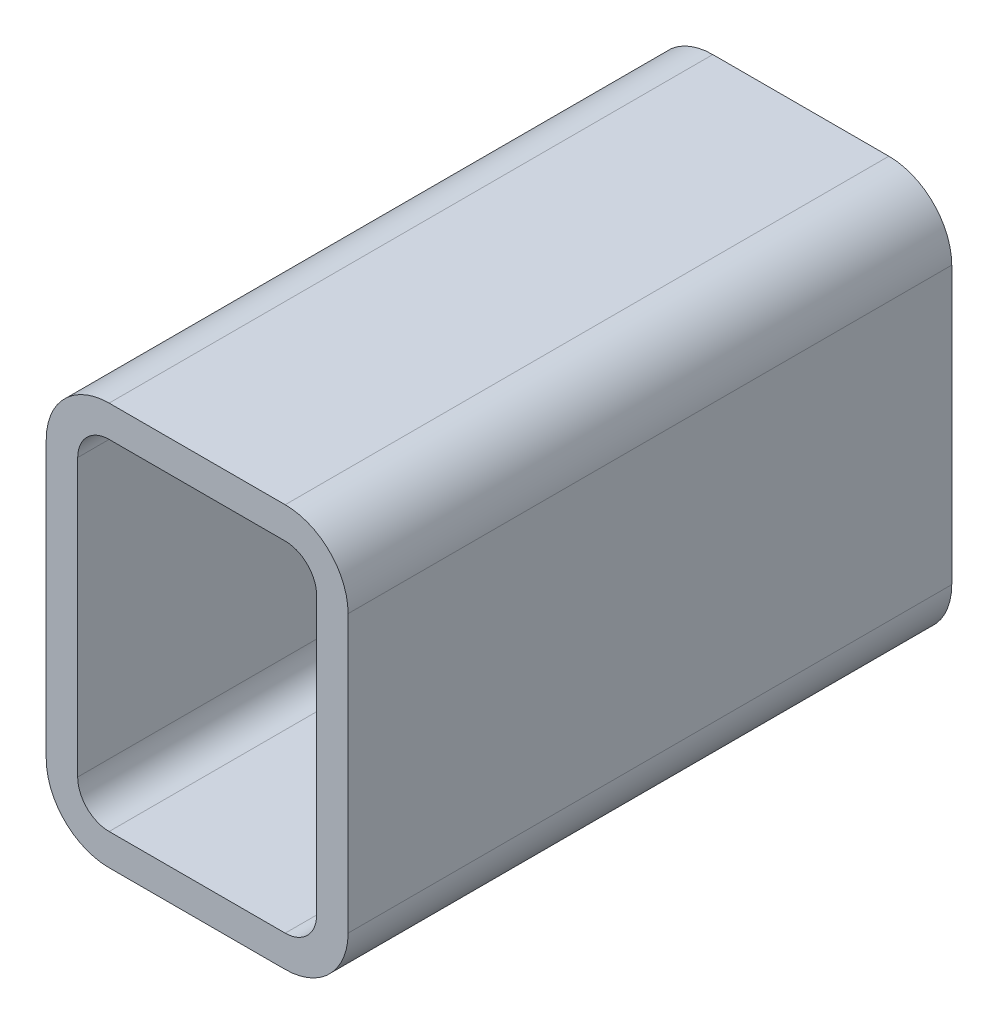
ISO-10303-21;
HEADER;
FILE_DESCRIPTION(('STEP AP214'),'2;1');
FILE_NAME('part.step','',(''),(''),'','','');
FILE_SCHEMA(('AUTOMOTIVE_DESIGN { 1 0 10303 214 1 1 1 1 }'));
ENDSEC;
DATA;
#1=APPLICATION_CONTEXT('core data for automotive mechanical design processes');
#2=APPLICATION_PROTOCOL_DEFINITION('international standard','automotive_design',2000,#1);
#3=PRODUCT_CONTEXT('',#1,'mechanical');
#4=PRODUCT('Part','Part','',(#3));
#5=PRODUCT_RELATED_PRODUCT_CATEGORY('part','',(#4));
#6=PRODUCT_DEFINITION_FORMATION('','',#4);
#7=PRODUCT_DEFINITION_CONTEXT('part definition',#1,'design');
#8=PRODUCT_DEFINITION('design','',#6,#7);
#9=PRODUCT_DEFINITION_SHAPE('','',#8);
#10=(LENGTH_UNIT() NAMED_UNIT(*) SI_UNIT(.MILLI.,.METRE.));
#11=(NAMED_UNIT(*) PLANE_ANGLE_UNIT() SI_UNIT($,.RADIAN.));
#12=(NAMED_UNIT(*) SI_UNIT($,.STERADIAN.) SOLID_ANGLE_UNIT());
#13=UNCERTAINTY_MEASURE_WITH_UNIT(LENGTH_MEASURE(1.E-05),#10,'distance_accuracy_value','');
#14=(GEOMETRIC_REPRESENTATION_CONTEXT(3) GLOBAL_UNCERTAINTY_ASSIGNED_CONTEXT((#13)) GLOBAL_UNIT_ASSIGNED_CONTEXT((#10,
#11,#12)) REPRESENTATION_CONTEXT('',''));
#15=CARTESIAN_POINT('',(0.,0.,0.));
#16=DIRECTION('',(0.,0.,1.));
#17=DIRECTION('',(1.,0.,0.));
#18=AXIS2_PLACEMENT_3D('',#15,#16,#17);
#19=CARTESIAN_POINT('',(31.7973013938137,173.416130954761,304.8));
#20=DIRECTION('',(0.,0.,1.));
#21=DIRECTION('',(1.,0.,0.));
#22=AXIS2_PLACEMENT_3D('',#19,#20,#21);
#23=PLANE('',#22);
#24=CARTESIAN_POINT('',(31.7973013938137,173.416130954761,304.8));
#25=DIRECTION('',(0.,0.,1.));
#26=DIRECTION('',(1.,0.,0.));
#27=AXIS2_PLACEMENT_3D('',#24,#25,#26);
#28=CIRCLE('',#27,31.75);
#29=CARTESIAN_POINT('',(31.7973013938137,205.166130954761,304.8));
#30=VERTEX_POINT('',#29);
#31=CARTESIAN_POINT('',(0.0473013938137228,173.416130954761,304.8));
#32=VERTEX_POINT('',#31);
#33=EDGE_CURVE('E211',#30,#32,#28,.T.);
#34=ORIENTED_EDGE('',*,*,#33,.T.);
#35=DIRECTION('',(0.,-1.,0.));
#36=VECTOR('',#35,1.);
#37=CARTESIAN_POINT('',(0.0473013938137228,33.7161309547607,304.8));
#38=LINE('',#37,#36);
#39=CARTESIAN_POINT('',(0.0473013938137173,33.7161309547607,304.8));
#40=VERTEX_POINT('',#39);
#41=EDGE_CURVE('E214',#32,#40,#38,.T.);
#42=ORIENTED_EDGE('',*,*,#41,.T.);
#43=CARTESIAN_POINT('',(31.7973013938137,33.7161309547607,304.8));
#44=DIRECTION('',(0.,0.,1.));
#45=DIRECTION('',(1.,0.,0.));
#46=AXIS2_PLACEMENT_3D('',#43,#44,#45);
#47=CIRCLE('',#46,31.75);
#48=CARTESIAN_POINT('',(31.7973013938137,1.96613095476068,304.8));
#49=VERTEX_POINT('',#48);
#50=EDGE_CURVE('E217',#40,#49,#47,.T.);
#51=ORIENTED_EDGE('',*,*,#50,.T.);
#52=DIRECTION('',(1.,0.,0.));
#53=VECTOR('',#52,1.);
#54=CARTESIAN_POINT('',(120.697301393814,1.96613095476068,304.8));
#55=LINE('',#54,#53);
#56=CARTESIAN_POINT('',(120.697301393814,1.96613095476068,304.8));
#57=VERTEX_POINT('',#56);
#58=EDGE_CURVE('E219',#49,#57,#55,.T.);
#59=ORIENTED_EDGE('',*,*,#58,.T.);
#60=CARTESIAN_POINT('',(120.697301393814,33.7161309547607,304.8));
#61=DIRECTION('',(0.,0.,1.));
#62=DIRECTION('',(1.,0.,0.));
#63=AXIS2_PLACEMENT_3D('',#60,#61,#62);
#64=CIRCLE('',#63,31.75);
#65=CARTESIAN_POINT('',(152.447301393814,33.7161309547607,304.8));
#66=VERTEX_POINT('',#65);
#67=EDGE_CURVE('E221',#57,#66,#64,.T.);
#68=ORIENTED_EDGE('',*,*,#67,.T.);
#69=DIRECTION('',(0.,1.,0.));
#70=VECTOR('',#69,1.);
#71=CARTESIAN_POINT('',(152.447301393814,173.416130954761,304.8));
#72=LINE('',#71,#70);
#73=CARTESIAN_POINT('',(152.447301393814,173.416130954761,304.8));
#74=VERTEX_POINT('',#73);
#75=EDGE_CURVE('E223',#66,#74,#72,.T.);
#76=ORIENTED_EDGE('',*,*,#75,.T.);
#77=CARTESIAN_POINT('',(120.697301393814,173.416130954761,304.8));
#78=DIRECTION('',(0.,0.,1.));
#79=DIRECTION('',(1.,0.,0.));
#80=AXIS2_PLACEMENT_3D('',#77,#78,#79);
#81=CIRCLE('',#80,31.75);
#82=CARTESIAN_POINT('',(120.697301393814,205.166130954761,304.8));
#83=VERTEX_POINT('',#82);
#84=EDGE_CURVE('E225',#74,#83,#81,.T.);
#85=ORIENTED_EDGE('',*,*,#84,.T.);
#86=DIRECTION('',(-1.,0.,0.));
#87=VECTOR('',#86,1.);
#88=CARTESIAN_POINT('',(31.7973013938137,205.166130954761,304.8));
#89=LINE('',#88,#87);
#90=EDGE_CURVE('E227',#83,#30,#89,.T.);
#91=ORIENTED_EDGE('',*,*,#90,.T.);
#92=EDGE_LOOP('',(#34,#42,#51,#59,#68,#76,#85,#91));
#93=FACE_BOUND('',#92,.T.);
#94=DIRECTION('',(0.,-1.,0.));
#95=VECTOR('',#94,1.);
#96=CARTESIAN_POINT('',(15.9223013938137,33.7161309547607,304.8));
#97=LINE('',#96,#95);
#98=CARTESIAN_POINT('',(15.9223013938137,173.416130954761,304.8));
#99=VERTEX_POINT('',#98);
#100=CARTESIAN_POINT('',(15.9223013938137,33.7161309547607,304.8));
#101=VERTEX_POINT('',#100);
#102=EDGE_CURVE('E154',#99,#101,#97,.T.);
#103=ORIENTED_EDGE('',*,*,#102,.F.);
#104=CARTESIAN_POINT('',(31.7973013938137,173.416130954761,304.8));
#105=DIRECTION('',(0.,0.,1.));
#106=DIRECTION('',(1.,0.,0.));
#107=AXIS2_PLACEMENT_3D('',#104,#105,#106);
#108=CIRCLE('',#107,15.875);
#109=CARTESIAN_POINT('',(31.7973013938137,189.291130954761,304.8));
#110=VERTEX_POINT('',#109);
#111=EDGE_CURVE('E146',#110,#99,#108,.T.);
#112=ORIENTED_EDGE('',*,*,#111,.F.);
#113=DIRECTION('',(-1.,0.,0.));
#114=VECTOR('',#113,1.);
#115=CARTESIAN_POINT('',(31.7973013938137,189.291130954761,304.8));
#116=LINE('',#115,#114);
#117=CARTESIAN_POINT('',(120.697301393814,189.291130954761,304.8));
#118=VERTEX_POINT('',#117);
#119=EDGE_CURVE('E179',#118,#110,#116,.T.);
#120=ORIENTED_EDGE('',*,*,#119,.F.);
#121=CARTESIAN_POINT('',(120.697301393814,173.416130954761,304.8));
#122=DIRECTION('',(0.,0.,1.));
#123=DIRECTION('',(1.,0.,0.));
#124=AXIS2_PLACEMENT_3D('',#121,#122,#123);
#125=CIRCLE('',#124,15.875);
#126=CARTESIAN_POINT('',(136.572301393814,173.416130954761,304.8));
#127=VERTEX_POINT('',#126);
#128=EDGE_CURVE('E177',#127,#118,#125,.T.);
#129=ORIENTED_EDGE('',*,*,#128,.F.);
#130=DIRECTION('',(0.,1.,0.));
#131=VECTOR('',#130,1.);
#132=CARTESIAN_POINT('',(136.572301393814,173.416130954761,304.8));
#133=LINE('',#132,#131);
#134=CARTESIAN_POINT('',(136.572301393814,33.7161309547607,304.8));
#135=VERTEX_POINT('',#134);
#136=EDGE_CURVE('E175',#135,#127,#133,.T.);
#137=ORIENTED_EDGE('',*,*,#136,.F.);
#138=CARTESIAN_POINT('',(120.697301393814,33.7161309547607,304.8));
#139=DIRECTION('',(0.,0.,1.));
#140=DIRECTION('',(1.,0.,0.));
#141=AXIS2_PLACEMENT_3D('',#138,#139,#140);
#142=CIRCLE('',#141,15.875);
#143=CARTESIAN_POINT('',(120.697301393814,17.8411309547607,304.8));
#144=VERTEX_POINT('',#143);
#145=EDGE_CURVE('E173',#144,#135,#142,.T.);
#146=ORIENTED_EDGE('',*,*,#145,.F.);
#147=DIRECTION('',(1.,0.,0.));
#148=VECTOR('',#147,1.);
#149=CARTESIAN_POINT('',(120.697301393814,17.8411309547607,304.8));
#150=LINE('',#149,#148);
#151=CARTESIAN_POINT('',(31.7973013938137,17.8411309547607,304.8));
#152=VERTEX_POINT('',#151);
#153=EDGE_CURVE('E169',#152,#144,#150,.T.);
#154=ORIENTED_EDGE('',*,*,#153,.F.);
#155=CARTESIAN_POINT('',(31.7973013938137,33.7161309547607,304.8));
#156=DIRECTION('',(0.,0.,1.));
#157=DIRECTION('',(1.,0.,0.));
#158=AXIS2_PLACEMENT_3D('',#155,#156,#157);
#159=CIRCLE('',#158,15.875);
#160=EDGE_CURVE('E167',#101,#152,#159,.T.);
#161=ORIENTED_EDGE('',*,*,#160,.F.);
#162=EDGE_LOOP('',(#103,#112,#120,#129,#137,#146,#154,#161));
#163=FACE_BOUND('',#162,.T.);
#164=ADVANCED_FACE('F33',(#93,#163),#23,.T.);
#165=CARTESIAN_POINT('',(31.7973013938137,173.416130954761,0.));
#166=DIRECTION('',(0.,0.,1.));
#167=DIRECTION('',(1.,0.,0.));
#168=AXIS2_PLACEMENT_3D('',#165,#166,#167);
#169=PLANE('',#168);
#170=CARTESIAN_POINT('',(31.7973013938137,173.416130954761,0.));
#171=DIRECTION('',(0.,0.,1.));
#172=DIRECTION('',(1.,0.,0.));
#173=AXIS2_PLACEMENT_3D('',#170,#171,#172);
#174=CIRCLE('',#173,31.75);
#175=CARTESIAN_POINT('',(31.7973013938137,205.166130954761,0.));
#176=VERTEX_POINT('',#175);
#177=CARTESIAN_POINT('',(0.0473013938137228,173.416130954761,0.));
#178=VERTEX_POINT('',#177);
#179=EDGE_CURVE('E162',#176,#178,#174,.T.);
#180=ORIENTED_EDGE('',*,*,#179,.F.);
#181=DIRECTION('',(-1.,0.,0.));
#182=VECTOR('',#181,1.);
#183=CARTESIAN_POINT('',(31.7973013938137,205.166130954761,0.));
#184=LINE('',#183,#182);
#185=CARTESIAN_POINT('',(120.697301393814,205.166130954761,0.));
#186=VERTEX_POINT('',#185);
#187=EDGE_CURVE('E215',#186,#176,#184,.T.);
#188=ORIENTED_EDGE('',*,*,#187,.F.);
#189=CARTESIAN_POINT('',(120.697301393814,173.416130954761,0.));
#190=DIRECTION('',(0.,0.,1.));
#191=DIRECTION('',(1.,0.,0.));
#192=AXIS2_PLACEMENT_3D('',#189,#190,#191);
#193=CIRCLE('',#192,31.75);
#194=CARTESIAN_POINT('',(152.447301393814,173.416130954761,0.));
#195=VERTEX_POINT('',#194);
#196=EDGE_CURVE('E242',#195,#186,#193,.T.);
#197=ORIENTED_EDGE('',*,*,#196,.F.);
#198=DIRECTION('',(0.,1.,0.));
#199=VECTOR('',#198,1.);
#200=CARTESIAN_POINT('',(152.447301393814,173.416130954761,0.));
#201=LINE('',#200,#199);
#202=CARTESIAN_POINT('',(152.447301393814,33.7161309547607,0.));
#203=VERTEX_POINT('',#202);
#204=EDGE_CURVE('E240',#203,#195,#201,.T.);
#205=ORIENTED_EDGE('',*,*,#204,.F.);
#206=CARTESIAN_POINT('',(120.697301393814,33.7161309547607,0.));
#207=DIRECTION('',(0.,0.,1.));
#208=DIRECTION('',(1.,0.,0.));
#209=AXIS2_PLACEMENT_3D('',#206,#207,#208);
#210=CIRCLE('',#209,31.75);
#211=CARTESIAN_POINT('',(120.697301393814,1.96613095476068,0.));
#212=VERTEX_POINT('',#211);
#213=EDGE_CURVE('E238',#212,#203,#210,.T.);
#214=ORIENTED_EDGE('',*,*,#213,.F.);
#215=DIRECTION('',(1.,0.,0.));
#216=VECTOR('',#215,1.);
#217=CARTESIAN_POINT('',(120.697301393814,1.96613095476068,0.));
#218=LINE('',#217,#216);
#219=CARTESIAN_POINT('',(31.7973013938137,1.96613095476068,0.));
#220=VERTEX_POINT('',#219);
#221=EDGE_CURVE('E236',#220,#212,#218,.T.);
#222=ORIENTED_EDGE('',*,*,#221,.F.);
#223=CARTESIAN_POINT('',(31.7973013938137,33.7161309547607,0.));
#224=DIRECTION('',(0.,0.,1.));
#225=DIRECTION('',(1.,0.,0.));
#226=AXIS2_PLACEMENT_3D('',#223,#224,#225);
#227=CIRCLE('',#226,31.75);
#228=CARTESIAN_POINT('',(0.0473013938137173,33.7161309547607,0.));
#229=VERTEX_POINT('',#228);
#230=EDGE_CURVE('E234',#229,#220,#227,.T.);
#231=ORIENTED_EDGE('',*,*,#230,.F.);
#232=DIRECTION('',(0.,-1.,0.));
#233=VECTOR('',#232,1.);
#234=CARTESIAN_POINT('',(0.0473013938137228,33.7161309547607,0.));
#235=LINE('',#234,#233);
#236=EDGE_CURVE('E232',#178,#229,#235,.T.);
#237=ORIENTED_EDGE('',*,*,#236,.F.);
#238=EDGE_LOOP('',(#180,#188,#197,#205,#214,#222,#231,#237));
#239=FACE_BOUND('',#238,.T.);
#240=CARTESIAN_POINT('',(31.7973013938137,173.416130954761,0.));
#241=DIRECTION('',(0.,0.,1.));
#242=DIRECTION('',(1.,0.,0.));
#243=AXIS2_PLACEMENT_3D('',#240,#241,#242);
#244=CIRCLE('',#243,15.875);
#245=CARTESIAN_POINT('',(31.7973013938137,189.291130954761,0.));
#246=VERTEX_POINT('',#245);
#247=CARTESIAN_POINT('',(15.9223013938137,173.416130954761,0.));
#248=VERTEX_POINT('',#247);
#249=EDGE_CURVE('E56',#246,#248,#244,.T.);
#250=ORIENTED_EDGE('',*,*,#249,.T.);
#251=DIRECTION('',(0.,-1.,0.));
#252=VECTOR('',#251,1.);
#253=CARTESIAN_POINT('',(15.9223013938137,33.7161309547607,0.));
#254=LINE('',#253,#252);
#255=CARTESIAN_POINT('',(15.9223013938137,33.7161309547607,0.));
#256=VERTEX_POINT('',#255);
#257=EDGE_CURVE('E161',#248,#256,#254,.T.);
#258=ORIENTED_EDGE('',*,*,#257,.T.);
#259=CARTESIAN_POINT('',(31.7973013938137,33.7161309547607,0.));
#260=DIRECTION('',(0.,0.,1.));
#261=DIRECTION('',(1.,0.,0.));
#262=AXIS2_PLACEMENT_3D('',#259,#260,#261);
#263=CIRCLE('',#262,15.875);
#264=CARTESIAN_POINT('',(31.7973013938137,17.8411309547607,0.));
#265=VERTEX_POINT('',#264);
#266=EDGE_CURVE('E183',#256,#265,#263,.T.);
#267=ORIENTED_EDGE('',*,*,#266,.T.);
#268=DIRECTION('',(1.,0.,0.));
#269=VECTOR('',#268,1.);
#270=CARTESIAN_POINT('',(120.697301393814,17.8411309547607,0.));
#271=LINE('',#270,#269);
#272=CARTESIAN_POINT('',(120.697301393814,17.8411309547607,0.));
#273=VERTEX_POINT('',#272);
#274=EDGE_CURVE('E186',#265,#273,#271,.T.);
#275=ORIENTED_EDGE('',*,*,#274,.T.);
#276=CARTESIAN_POINT('',(120.697301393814,33.7161309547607,0.));
#277=DIRECTION('',(0.,0.,1.));
#278=DIRECTION('',(1.,0.,0.));
#279=AXIS2_PLACEMENT_3D('',#276,#277,#278);
#280=CIRCLE('',#279,15.875);
#281=CARTESIAN_POINT('',(136.572301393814,33.7161309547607,0.));
#282=VERTEX_POINT('',#281);
#283=EDGE_CURVE('E189',#273,#282,#280,.T.);
#284=ORIENTED_EDGE('',*,*,#283,.T.);
#285=DIRECTION('',(0.,1.,0.));
#286=VECTOR('',#285,1.);
#287=CARTESIAN_POINT('',(136.572301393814,173.416130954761,0.));
#288=LINE('',#287,#286);
#289=CARTESIAN_POINT('',(136.572301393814,173.416130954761,0.));
#290=VERTEX_POINT('',#289);
#291=EDGE_CURVE('E192',#282,#290,#288,.T.);
#292=ORIENTED_EDGE('',*,*,#291,.T.);
#293=CARTESIAN_POINT('',(120.697301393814,173.416130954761,0.));
#294=DIRECTION('',(0.,0.,1.));
#295=DIRECTION('',(1.,0.,0.));
#296=AXIS2_PLACEMENT_3D('',#293,#294,#295);
#297=CIRCLE('',#296,15.875);
#298=CARTESIAN_POINT('',(120.697301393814,189.291130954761,0.));
#299=VERTEX_POINT('',#298);
#300=EDGE_CURVE('E195',#290,#299,#297,.T.);
#301=ORIENTED_EDGE('',*,*,#300,.T.);
#302=DIRECTION('',(-1.,0.,0.));
#303=VECTOR('',#302,1.);
#304=CARTESIAN_POINT('',(31.7973013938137,189.291130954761,0.));
#305=LINE('',#304,#303);
#306=EDGE_CURVE('E155',#299,#246,#305,.T.);
#307=ORIENTED_EDGE('',*,*,#306,.T.);
#308=EDGE_LOOP('',(#250,#258,#267,#275,#284,#292,#301,#307));
#309=FACE_BOUND('',#308,.T.);
#310=ADVANCED_FACE('F272',(#239,#309),#169,.F.);
#311=CARTESIAN_POINT('',(31.7973013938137,173.416130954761,304.8));
#312=DIRECTION('',(0.,0.,-1.));
#313=DIRECTION('',(-1.,0.,0.));
#314=AXIS2_PLACEMENT_3D('',#311,#312,#313);
#315=CYLINDRICAL_SURFACE('',#314,31.75);
#316=ORIENTED_EDGE('',*,*,#179,.T.);
#317=DIRECTION('',(0.,0.,-1.));
#318=VECTOR('',#317,1.);
#319=CARTESIAN_POINT('',(0.0473013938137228,173.416130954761,304.8));
#320=LINE('',#319,#318);
#321=EDGE_CURVE('E11',#32,#178,#320,.T.);
#322=ORIENTED_EDGE('',*,*,#321,.F.);
#323=ORIENTED_EDGE('',*,*,#33,.F.);
#324=DIRECTION('',(0.,0.,-1.));
#325=VECTOR('',#324,1.);
#326=CARTESIAN_POINT('',(31.7973013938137,205.166130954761,304.8));
#327=LINE('',#326,#325);
#328=EDGE_CURVE('E229',#30,#176,#327,.T.);
#329=ORIENTED_EDGE('',*,*,#328,.T.);
#330=EDGE_LOOP('',(#316,#322,#323,#329));
#331=FACE_BOUND('',#330,.T.);
#332=ADVANCED_FACE('F35',(#331),#315,.T.);
#333=CARTESIAN_POINT('',(0.0473013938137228,33.7161309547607,304.8));
#334=DIRECTION('',(1.,0.,0.));
#335=DIRECTION('',(0.,0.,-1.));
#336=AXIS2_PLACEMENT_3D('',#333,#334,#335);
#337=PLANE('',#336);
#338=ORIENTED_EDGE('',*,*,#236,.T.);
#339=DIRECTION('',(0.,0.,-1.));
#340=VECTOR('',#339,1.);
#341=CARTESIAN_POINT('',(0.0473013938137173,33.7161309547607,304.8));
#342=LINE('',#341,#340);
#343=EDGE_CURVE('E41',#40,#229,#342,.T.);
#344=ORIENTED_EDGE('',*,*,#343,.F.);
#345=ORIENTED_EDGE('',*,*,#41,.F.);
#346=ORIENTED_EDGE('',*,*,#321,.T.);
#347=EDGE_LOOP('',(#338,#344,#345,#346));
#348=FACE_BOUND('',#347,.T.);
#349=ADVANCED_FACE('F289',(#348),#337,.F.);
#350=CARTESIAN_POINT('',(31.7973013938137,33.7161309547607,304.8));
#351=DIRECTION('',(0.,0.,-1.));
#352=DIRECTION('',(-1.,0.,0.));
#353=AXIS2_PLACEMENT_3D('',#350,#351,#352);
#354=CYLINDRICAL_SURFACE('',#353,31.75);
#355=ORIENTED_EDGE('',*,*,#230,.T.);
#356=DIRECTION('',(0.,0.,-1.));
#357=VECTOR('',#356,1.);
#358=CARTESIAN_POINT('',(31.7973013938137,1.96613095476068,304.8));
#359=LINE('',#358,#357);
#360=EDGE_CURVE('E259',#49,#220,#359,.T.);
#361=ORIENTED_EDGE('',*,*,#360,.F.);
#362=ORIENTED_EDGE('',*,*,#50,.F.);
#363=ORIENTED_EDGE('',*,*,#343,.T.);
#364=EDGE_LOOP('',(#355,#361,#362,#363));
#365=FACE_BOUND('',#364,.T.);
#366=ADVANCED_FACE('F266',(#365),#354,.T.);
#367=CARTESIAN_POINT('',(120.697301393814,1.96613095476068,304.8));
#368=DIRECTION('',(0.,1.,0.));
#369=DIRECTION('',(0.,0.,1.));
#370=AXIS2_PLACEMENT_3D('',#367,#368,#369);
#371=PLANE('',#370);
#372=ORIENTED_EDGE('',*,*,#221,.T.);
#373=DIRECTION('',(0.,0.,-1.));
#374=VECTOR('',#373,1.);
#375=CARTESIAN_POINT('',(120.697301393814,1.96613095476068,304.8));
#376=LINE('',#375,#374);
#377=EDGE_CURVE('E256',#57,#212,#376,.T.);
#378=ORIENTED_EDGE('',*,*,#377,.F.);
#379=ORIENTED_EDGE('',*,*,#58,.F.);
#380=ORIENTED_EDGE('',*,*,#360,.T.);
#381=EDGE_LOOP('',(#372,#378,#379,#380));
#382=FACE_BOUND('',#381,.T.);
#383=ADVANCED_FACE('F278',(#382),#371,.F.);
#384=CARTESIAN_POINT('',(120.697301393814,33.7161309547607,304.8));
#385=DIRECTION('',(0.,0.,-1.));
#386=DIRECTION('',(-1.,0.,0.));
#387=AXIS2_PLACEMENT_3D('',#384,#385,#386);
#388=CYLINDRICAL_SURFACE('',#387,31.75);
#389=ORIENTED_EDGE('',*,*,#213,.T.);
#390=DIRECTION('',(0.,0.,-1.));
#391=VECTOR('',#390,1.);
#392=CARTESIAN_POINT('',(152.447301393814,33.7161309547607,304.8));
#393=LINE('',#392,#391);
#394=EDGE_CURVE('E253',#66,#203,#393,.T.);
#395=ORIENTED_EDGE('',*,*,#394,.F.);
#396=ORIENTED_EDGE('',*,*,#67,.F.);
#397=ORIENTED_EDGE('',*,*,#377,.T.);
#398=EDGE_LOOP('',(#389,#395,#396,#397));
#399=FACE_BOUND('',#398,.T.);
#400=ADVANCED_FACE('F282',(#399),#388,.T.);
#401=CARTESIAN_POINT('',(152.447301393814,173.416130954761,304.8));
#402=DIRECTION('',(-1.,0.,0.));
#403=DIRECTION('',(0.,0.,1.));
#404=AXIS2_PLACEMENT_3D('',#401,#402,#403);
#405=PLANE('',#404);
#406=ORIENTED_EDGE('',*,*,#204,.T.);
#407=DIRECTION('',(0.,0.,-1.));
#408=VECTOR('',#407,1.);
#409=CARTESIAN_POINT('',(152.447301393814,173.416130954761,304.8));
#410=LINE('',#409,#408);
#411=EDGE_CURVE('E250',#74,#195,#410,.T.);
#412=ORIENTED_EDGE('',*,*,#411,.F.);
#413=ORIENTED_EDGE('',*,*,#75,.F.);
#414=ORIENTED_EDGE('',*,*,#394,.T.);
#415=EDGE_LOOP('',(#406,#412,#413,#414));
#416=FACE_BOUND('',#415,.T.);
#417=ADVANCED_FACE('F302',(#416),#405,.F.);
#418=CARTESIAN_POINT('',(120.697301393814,173.416130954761,304.8));
#419=DIRECTION('',(0.,0.,-1.));
#420=DIRECTION('',(-1.,0.,0.));
#421=AXIS2_PLACEMENT_3D('',#418,#419,#420);
#422=CYLINDRICAL_SURFACE('',#421,31.75);
#423=ORIENTED_EDGE('',*,*,#196,.T.);
#424=DIRECTION('',(0.,0.,-1.));
#425=VECTOR('',#424,1.);
#426=CARTESIAN_POINT('',(120.697301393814,205.166130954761,304.8));
#427=LINE('',#426,#425);
#428=EDGE_CURVE('E247',#83,#186,#427,.T.);
#429=ORIENTED_EDGE('',*,*,#428,.F.);
#430=ORIENTED_EDGE('',*,*,#84,.F.);
#431=ORIENTED_EDGE('',*,*,#411,.T.);
#432=EDGE_LOOP('',(#423,#429,#430,#431));
#433=FACE_BOUND('',#432,.T.);
#434=ADVANCED_FACE('F300',(#433),#422,.T.);
#435=CARTESIAN_POINT('',(31.7973013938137,205.166130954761,304.8));
#436=DIRECTION('',(0.,-1.,0.));
#437=DIRECTION('',(0.,0.,-1.));
#438=AXIS2_PLACEMENT_3D('',#435,#436,#437);
#439=PLANE('',#438);
#440=ORIENTED_EDGE('',*,*,#187,.T.);
#441=ORIENTED_EDGE('',*,*,#328,.F.);
#442=ORIENTED_EDGE('',*,*,#90,.F.);
#443=ORIENTED_EDGE('',*,*,#428,.T.);
#444=EDGE_LOOP('',(#440,#441,#442,#443));
#445=FACE_BOUND('',#444,.T.);
#446=ADVANCED_FACE('F295',(#445),#439,.F.);
#447=CARTESIAN_POINT('',(31.7973013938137,173.416130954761,304.8));
#448=DIRECTION('',(0.,0.,-1.));
#449=DIRECTION('',(-1.,0.,0.));
#450=AXIS2_PLACEMENT_3D('',#447,#448,#449);
#451=CYLINDRICAL_SURFACE('',#450,15.875);
#452=ORIENTED_EDGE('',*,*,#249,.F.);
#453=DIRECTION('',(0.,0.,-1.));
#454=VECTOR('',#453,1.);
#455=CARTESIAN_POINT('',(31.7973013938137,189.291130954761,304.8));
#456=LINE('',#455,#454);
#457=EDGE_CURVE('E150',#110,#246,#456,.T.);
#458=ORIENTED_EDGE('',*,*,#457,.F.);
#459=ORIENTED_EDGE('',*,*,#111,.T.);
#460=DIRECTION('',(0.,0.,-1.));
#461=VECTOR('',#460,1.);
#462=CARTESIAN_POINT('',(15.9223013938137,173.416130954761,304.8));
#463=LINE('',#462,#461);
#464=EDGE_CURVE('E149',#99,#248,#463,.T.);
#465=ORIENTED_EDGE('',*,*,#464,.T.);
#466=EDGE_LOOP('',(#452,#458,#459,#465));
#467=FACE_BOUND('',#466,.T.);
#468=ADVANCED_FACE('F148',(#467),#451,.F.);
#469=CARTESIAN_POINT('',(15.9223013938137,33.7161309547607,304.8));
#470=DIRECTION('',(1.,0.,0.));
#471=DIRECTION('',(0.,0.,-1.));
#472=AXIS2_PLACEMENT_3D('',#469,#470,#471);
#473=PLANE('',#472);
#474=ORIENTED_EDGE('',*,*,#257,.F.);
#475=ORIENTED_EDGE('',*,*,#464,.F.);
#476=ORIENTED_EDGE('',*,*,#102,.T.);
#477=DIRECTION('',(0.,0.,-1.));
#478=VECTOR('',#477,1.);
#479=CARTESIAN_POINT('',(15.9223013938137,33.7161309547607,304.8));
#480=LINE('',#479,#478);
#481=EDGE_CURVE('E163',#101,#256,#480,.T.);
#482=ORIENTED_EDGE('',*,*,#481,.T.);
#483=EDGE_LOOP('',(#474,#475,#476,#482));
#484=FACE_BOUND('',#483,.T.);
#485=ADVANCED_FACE('F158',(#484),#473,.T.);
#486=CARTESIAN_POINT('',(31.7973013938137,33.7161309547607,304.8));
#487=DIRECTION('',(0.,0.,-1.));
#488=DIRECTION('',(-1.,0.,0.));
#489=AXIS2_PLACEMENT_3D('',#486,#487,#488);
#490=CYLINDRICAL_SURFACE('',#489,15.875);
#491=ORIENTED_EDGE('',*,*,#266,.F.);
#492=ORIENTED_EDGE('',*,*,#481,.F.);
#493=ORIENTED_EDGE('',*,*,#160,.T.);
#494=DIRECTION('',(0.,0.,-1.));
#495=VECTOR('',#494,1.);
#496=CARTESIAN_POINT('',(31.7973013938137,17.8411309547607,304.8));
#497=LINE('',#496,#495);
#498=EDGE_CURVE('E208',#152,#265,#497,.T.);
#499=ORIENTED_EDGE('',*,*,#498,.T.);
#500=EDGE_LOOP('',(#491,#492,#493,#499));
#501=FACE_BOUND('',#500,.T.);
#502=ADVANCED_FACE('F327',(#501),#490,.F.);
#503=CARTESIAN_POINT('',(120.697301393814,17.8411309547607,304.8));
#504=DIRECTION('',(0.,1.,0.));
#505=DIRECTION('',(0.,0.,1.));
#506=AXIS2_PLACEMENT_3D('',#503,#504,#505);
#507=PLANE('',#506);
#508=ORIENTED_EDGE('',*,*,#274,.F.);
#509=ORIENTED_EDGE('',*,*,#498,.F.);
#510=ORIENTED_EDGE('',*,*,#153,.T.);
#511=DIRECTION('',(0.,0.,-1.));
#512=VECTOR('',#511,1.);
#513=CARTESIAN_POINT('',(120.697301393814,17.8411309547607,304.8));
#514=LINE('',#513,#512);
#515=EDGE_CURVE('E206',#144,#273,#514,.T.);
#516=ORIENTED_EDGE('',*,*,#515,.T.);
#517=EDGE_LOOP('',(#508,#509,#510,#516));
#518=FACE_BOUND('',#517,.T.);
#519=ADVANCED_FACE('F331',(#518),#507,.T.);
#520=CARTESIAN_POINT('',(120.697301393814,33.7161309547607,304.8));
#521=DIRECTION('',(0.,0.,-1.));
#522=DIRECTION('',(-1.,0.,0.));
#523=AXIS2_PLACEMENT_3D('',#520,#521,#522);
#524=CYLINDRICAL_SURFACE('',#523,15.875);
#525=ORIENTED_EDGE('',*,*,#283,.F.);
#526=ORIENTED_EDGE('',*,*,#515,.F.);
#527=ORIENTED_EDGE('',*,*,#145,.T.);
#528=DIRECTION('',(0.,0.,-1.));
#529=VECTOR('',#528,1.);
#530=CARTESIAN_POINT('',(136.572301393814,33.7161309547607,304.8));
#531=LINE('',#530,#529);
#532=EDGE_CURVE('E204',#135,#282,#531,.T.);
#533=ORIENTED_EDGE('',*,*,#532,.T.);
#534=EDGE_LOOP('',(#525,#526,#527,#533));
#535=FACE_BOUND('',#534,.T.);
#536=ADVANCED_FACE('F337',(#535),#524,.F.);
#537=CARTESIAN_POINT('',(136.572301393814,173.416130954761,304.8));
#538=DIRECTION('',(-1.,0.,0.));
#539=DIRECTION('',(0.,0.,1.));
#540=AXIS2_PLACEMENT_3D('',#537,#538,#539);
#541=PLANE('',#540);
#542=ORIENTED_EDGE('',*,*,#291,.F.);
#543=ORIENTED_EDGE('',*,*,#532,.F.);
#544=ORIENTED_EDGE('',*,*,#136,.T.);
#545=DIRECTION('',(0.,0.,-1.));
#546=VECTOR('',#545,1.);
#547=CARTESIAN_POINT('',(136.572301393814,173.416130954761,304.8));
#548=LINE('',#547,#546);
#549=EDGE_CURVE('E202',#127,#290,#548,.T.);
#550=ORIENTED_EDGE('',*,*,#549,.T.);
#551=EDGE_LOOP('',(#542,#543,#544,#550));
#552=FACE_BOUND('',#551,.T.);
#553=ADVANCED_FACE('F341',(#552),#541,.T.);
#554=CARTESIAN_POINT('',(120.697301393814,173.416130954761,304.8));
#555=DIRECTION('',(0.,0.,-1.));
#556=DIRECTION('',(-1.,0.,0.));
#557=AXIS2_PLACEMENT_3D('',#554,#555,#556);
#558=CYLINDRICAL_SURFACE('',#557,15.875);
#559=ORIENTED_EDGE('',*,*,#300,.F.);
#560=ORIENTED_EDGE('',*,*,#549,.F.);
#561=ORIENTED_EDGE('',*,*,#128,.T.);
#562=DIRECTION('',(0.,0.,-1.));
#563=VECTOR('',#562,1.);
#564=CARTESIAN_POINT('',(120.697301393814,189.291130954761,304.8));
#565=LINE('',#564,#563);
#566=EDGE_CURVE('E48',#118,#299,#565,.T.);
#567=ORIENTED_EDGE('',*,*,#566,.T.);
#568=EDGE_LOOP('',(#559,#560,#561,#567));
#569=FACE_BOUND('',#568,.T.);
#570=ADVANCED_FACE('F345',(#569),#558,.F.);
#571=CARTESIAN_POINT('',(31.7973013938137,189.291130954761,304.8));
#572=DIRECTION('',(0.,-1.,0.));
#573=DIRECTION('',(0.,0.,-1.));
#574=AXIS2_PLACEMENT_3D('',#571,#572,#573);
#575=PLANE('',#574);
#576=ORIENTED_EDGE('',*,*,#306,.F.);
#577=ORIENTED_EDGE('',*,*,#566,.F.);
#578=ORIENTED_EDGE('',*,*,#119,.T.);
#579=ORIENTED_EDGE('',*,*,#457,.T.);
#580=EDGE_LOOP('',(#576,#577,#578,#579));
#581=FACE_BOUND('',#580,.T.);
#582=ADVANCED_FACE('F349',(#581),#575,.T.);
#583=CLOSED_SHELL('',(#164,#310,#332,#349,#366,#383,#400,#417,#434,#446,#468,#485,#502,#519,
#536,#553,#570,#582));
#584=MANIFOLD_SOLID_BREP('B2',#583);
#585=ADVANCED_BREP_SHAPE_REPRESENTATION('',(#18,#584),#14);
#586=SHAPE_DEFINITION_REPRESENTATION(#9,#585);
ENDSEC;
END-ISO-10303-21;
